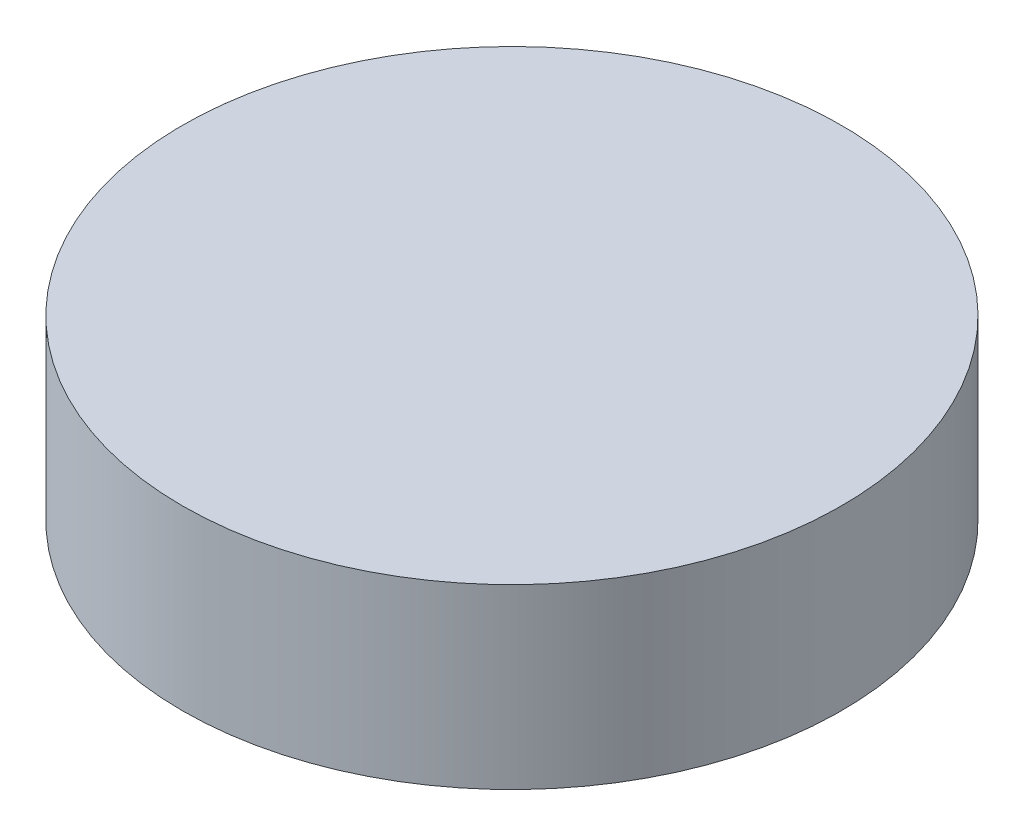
ISO-10303-21;
HEADER;
FILE_DESCRIPTION(('STEP AP214'),'2;1');
FILE_NAME('part.step','',(''),(''),'','','');
FILE_SCHEMA(('AUTOMOTIVE_DESIGN { 1 0 10303 214 1 1 1 1 }'));
ENDSEC;
DATA;
#1=APPLICATION_CONTEXT('core data for automotive mechanical design processes');
#2=APPLICATION_PROTOCOL_DEFINITION('international standard','automotive_design',2000,#1);
#3=PRODUCT_CONTEXT('',#1,'mechanical');
#4=PRODUCT('Part','Part','',(#3));
#5=PRODUCT_RELATED_PRODUCT_CATEGORY('part','',(#4));
#6=PRODUCT_DEFINITION_FORMATION('','',#4);
#7=PRODUCT_DEFINITION_CONTEXT('part definition',#1,'design');
#8=PRODUCT_DEFINITION('design','',#6,#7);
#9=PRODUCT_DEFINITION_SHAPE('','',#8);
#10=(LENGTH_UNIT() NAMED_UNIT(*) SI_UNIT(.MILLI.,.METRE.));
#11=(NAMED_UNIT(*) PLANE_ANGLE_UNIT() SI_UNIT($,.RADIAN.));
#12=(NAMED_UNIT(*) SI_UNIT($,.STERADIAN.) SOLID_ANGLE_UNIT());
#13=UNCERTAINTY_MEASURE_WITH_UNIT(LENGTH_MEASURE(1.E-05),#10,'distance_accuracy_value','');
#14=(GEOMETRIC_REPRESENTATION_CONTEXT(3) GLOBAL_UNCERTAINTY_ASSIGNED_CONTEXT((#13)) GLOBAL_UNIT_ASSIGNED_CONTEXT((#10,
#11,#12)) REPRESENTATION_CONTEXT('',''));
#15=CARTESIAN_POINT('',(0.,0.,0.));
#16=DIRECTION('',(0.,0.,1.));
#17=DIRECTION('',(1.,0.,0.));
#18=AXIS2_PLACEMENT_3D('',#15,#16,#17);
#19=CARTESIAN_POINT('',(0.,35.,0.));
#20=DIRECTION('',(0.,-1.,0.));
#21=DIRECTION('',(0.,0.,-1.));
#22=AXIS2_PLACEMENT_3D('',#19,#20,#21);
#23=CYLINDRICAL_SURFACE('',#22,65.);
#24=CARTESIAN_POINT('',(0.,35.,0.));
#25=DIRECTION('',(0.,1.,0.));
#26=DIRECTION('',(0.,0.,1.));
#27=AXIS2_PLACEMENT_3D('',#24,#25,#26);
#28=CIRCLE('',#27,65.);
#29=CARTESIAN_POINT('',(0.,35.,65.));
#30=VERTEX_POINT('',#29);
#31=EDGE_CURVE('E10',#30,#30,#28,.T.);
#32=ORIENTED_EDGE('',*,*,#31,.F.);
#33=EDGE_LOOP('',(#32));
#34=FACE_BOUND('',#33,.T.);
#35=CARTESIAN_POINT('',(0.,0.,0.));
#36=DIRECTION('',(0.,1.,0.));
#37=DIRECTION('',(0.,0.,1.));
#38=AXIS2_PLACEMENT_3D('',#35,#36,#37);
#39=CIRCLE('',#38,65.);
#40=CARTESIAN_POINT('',(0.,0.,65.));
#41=VERTEX_POINT('',#40);
#42=EDGE_CURVE('E34',#41,#41,#39,.T.);
#43=ORIENTED_EDGE('',*,*,#42,.T.);
#44=EDGE_LOOP('',(#43));
#45=FACE_BOUND('',#44,.T.);
#46=ADVANCED_FACE('F31',(#34,#45),#23,.T.);
#47=CARTESIAN_POINT('',(0.,35.,0.));
#48=DIRECTION('',(0.,1.,0.));
#49=DIRECTION('',(0.,0.,1.));
#50=AXIS2_PLACEMENT_3D('',#47,#48,#49);
#51=PLANE('',#50);
#52=ORIENTED_EDGE('',*,*,#31,.T.);
#53=EDGE_LOOP('',(#52));
#54=FACE_BOUND('',#53,.T.);
#55=ADVANCED_FACE('F46',(#54),#51,.T.);
#56=CARTESIAN_POINT('',(0.,0.,0.));
#57=DIRECTION('',(0.,1.,0.));
#58=DIRECTION('',(0.,0.,1.));
#59=AXIS2_PLACEMENT_3D('',#56,#57,#58);
#60=PLANE('',#59);
#61=ORIENTED_EDGE('',*,*,#42,.F.);
#62=EDGE_LOOP('',(#61));
#63=FACE_BOUND('',#62,.T.);
#64=ADVANCED_FACE('F44',(#63),#60,.F.);
#65=CLOSED_SHELL('',(#46,#55,#64));
#66=MANIFOLD_SOLID_BREP('B2',#65);
#67=ADVANCED_BREP_SHAPE_REPRESENTATION('',(#18,#66),#14);
#68=SHAPE_DEFINITION_REPRESENTATION(#9,#67);
ENDSEC;
END-ISO-10303-21;
